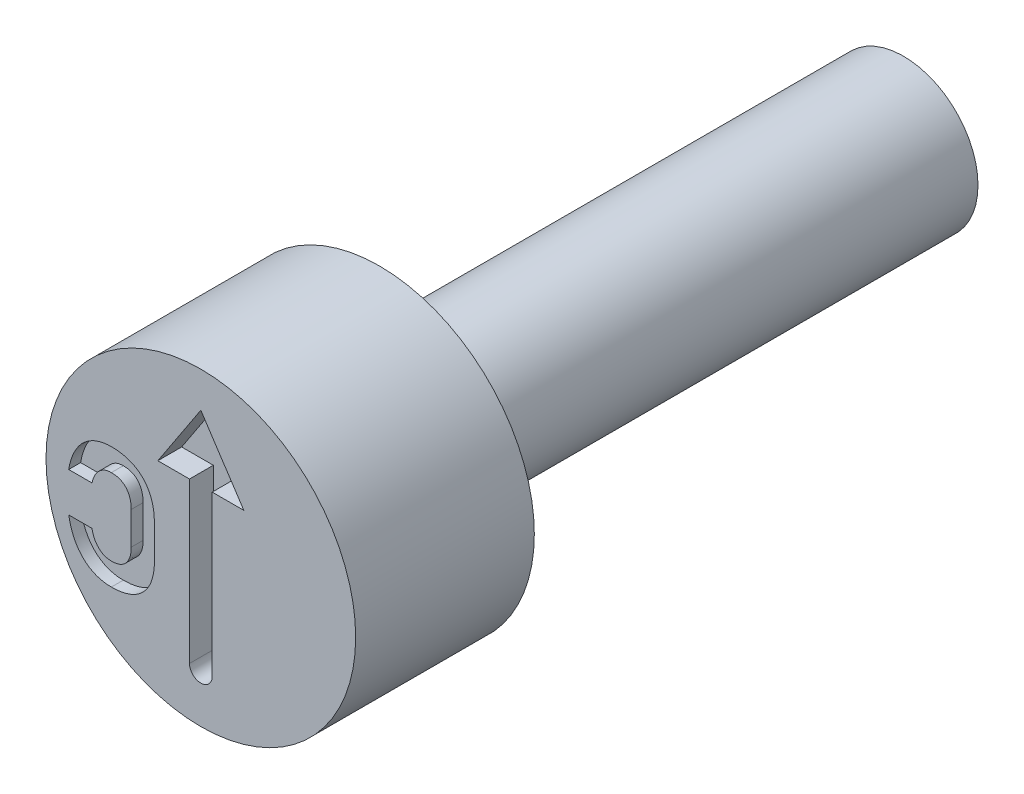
ISO-10303-21;
HEADER;
FILE_DESCRIPTION(('STEP AP214'),'2;1');
FILE_NAME('part.step','',(''),(''),'','','');
FILE_SCHEMA(('AUTOMOTIVE_DESIGN { 1 0 10303 214 1 1 1 1 }'));
ENDSEC;
DATA;
#1=APPLICATION_CONTEXT('core data for automotive mechanical design processes');
#2=APPLICATION_PROTOCOL_DEFINITION('international standard','automotive_design',2000,#1);
#3=PRODUCT_CONTEXT('',#1,'mechanical');
#4=PRODUCT('Part','Part','',(#3));
#5=PRODUCT_RELATED_PRODUCT_CATEGORY('part','',(#4));
#6=PRODUCT_DEFINITION_FORMATION('','',#4);
#7=PRODUCT_DEFINITION_CONTEXT('part definition',#1,'design');
#8=PRODUCT_DEFINITION('design','',#6,#7);
#9=PRODUCT_DEFINITION_SHAPE('','',#8);
#10=(LENGTH_UNIT() NAMED_UNIT(*) SI_UNIT(.MILLI.,.METRE.));
#11=(NAMED_UNIT(*) PLANE_ANGLE_UNIT() SI_UNIT($,.RADIAN.));
#12=(NAMED_UNIT(*) SI_UNIT($,.STERADIAN.) SOLID_ANGLE_UNIT());
#13=UNCERTAINTY_MEASURE_WITH_UNIT(LENGTH_MEASURE(1.E-05),#10,'distance_accuracy_value','');
#14=(GEOMETRIC_REPRESENTATION_CONTEXT(3) GLOBAL_UNCERTAINTY_ASSIGNED_CONTEXT((#13)) GLOBAL_UNIT_ASSIGNED_CONTEXT((#10,
#11,#12)) REPRESENTATION_CONTEXT('',''));
#15=CARTESIAN_POINT('',(0.,0.,0.));
#16=DIRECTION('',(0.,0.,1.));
#17=DIRECTION('',(1.,0.,0.));
#18=AXIS2_PLACEMENT_3D('',#15,#16,#17);
#19=CARTESIAN_POINT('',(0.,1.25,-3.));
#20=DIRECTION('',(0.,0.,1.));
#21=DIRECTION('',(1.,0.,0.));
#22=AXIS2_PLACEMENT_3D('',#19,#20,#21);
#23=PLANE('',#22);
#24=CARTESIAN_POINT('',(0.,0.,-3.));
#25=DIRECTION('',(0.,0.,1.));
#26=DIRECTION('',(1.,0.,0.));
#27=AXIS2_PLACEMENT_3D('',#24,#25,#26);
#28=CIRCLE('',#27,2.6);
#29=CARTESIAN_POINT('',(2.6,0.,-3.));
#30=VERTEX_POINT('',#29);
#31=EDGE_CURVE('E11',#30,#30,#28,.T.);
#32=ORIENTED_EDGE('',*,*,#31,.F.);
#33=EDGE_LOOP('',(#32));
#34=FACE_BOUND('',#33,.T.);
#35=CARTESIAN_POINT('',(0.,0.,-3.));
#36=DIRECTION('',(0.,0.,1.));
#37=DIRECTION('',(1.,0.,0.));
#38=AXIS2_PLACEMENT_3D('',#35,#36,#37);
#39=CIRCLE('',#38,1.25);
#40=CARTESIAN_POINT('',(1.25,0.,-3.));
#41=VERTEX_POINT('',#40);
#42=EDGE_CURVE('E262',#41,#41,#39,.T.);
#43=ORIENTED_EDGE('',*,*,#42,.T.);
#44=EDGE_LOOP('',(#43));
#45=FACE_BOUND('',#44,.T.);
#46=ADVANCED_FACE('F34',(#34,#45),#23,.F.);
#47=CARTESIAN_POINT('',(0.,0.,-0.403888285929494));
#48=DIRECTION('',(0.,0.,1.));
#49=DIRECTION('',(1.,0.,0.));
#50=AXIS2_PLACEMENT_3D('',#47,#48,#49);
#51=CYLINDRICAL_SURFACE('',#50,2.6);
#52=CARTESIAN_POINT('',(0.,0.,0.));
#53=DIRECTION('',(0.,0.,1.));
#54=DIRECTION('',(1.,0.,0.));
#55=AXIS2_PLACEMENT_3D('',#52,#53,#54);
#56=CIRCLE('',#55,2.6);
#57=CARTESIAN_POINT('',(2.6,0.,0.));
#58=VERTEX_POINT('',#57);
#59=EDGE_CURVE('E41',#58,#58,#56,.T.);
#60=ORIENTED_EDGE('',*,*,#59,.F.);
#61=EDGE_LOOP('',(#60));
#62=FACE_BOUND('',#61,.T.);
#63=ORIENTED_EDGE('',*,*,#31,.T.);
#64=EDGE_LOOP('',(#63));
#65=FACE_BOUND('',#64,.T.);
#66=ADVANCED_FACE('F247',(#62,#65),#51,.T.);
#67=CARTESIAN_POINT('',(0.,2.6,0.));
#68=DIRECTION('',(0.,0.,-1.));
#69=DIRECTION('',(-1.,0.,0.));
#70=AXIS2_PLACEMENT_3D('',#67,#68,#69);
#71=PLANE('',#70);
#72=CARTESIAN_POINT('',(-1.50238434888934,-1.32078663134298,0.));
#73=CARTESIAN_POINT('',(-1.48376416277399,-1.32058522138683,0.));
#74=CARTESIAN_POINT('',(-1.44702076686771,-1.32018777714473,0.));
#75=CARTESIAN_POINT('',(-1.39299257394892,-1.31605229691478,0.));
#76=CARTESIAN_POINT('',(-1.34086860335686,-1.30913923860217,0.));
#77=CARTESIAN_POINT('',(-1.2909331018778,-1.29939059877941,0.));
#78=CARTESIAN_POINT('',(-1.24304812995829,-1.28709241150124,0.));
#79=CARTESIAN_POINT('',(-1.19700867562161,-1.27255629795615,0.));
#80=CARTESIAN_POINT('',(-1.15325773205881,-1.25456123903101,0.));
#81=CARTESIAN_POINT('',(-1.11137066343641,-1.23415450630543,0.));
#82=CARTESIAN_POINT('',(-1.07193732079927,-1.21105723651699,0.));
#83=CARTESIAN_POINT('',(-1.03504126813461,-1.18507763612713,0.));
#84=CARTESIAN_POINT('',(-1.00031666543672,-1.15703082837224,0.));
#85=CARTESIAN_POINT('',(-0.968027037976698,-1.1263544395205,0.));
#86=CARTESIAN_POINT('',(-0.938205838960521,-1.09322771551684,0.));
#87=CARTESIAN_POINT('',(-0.910683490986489,-1.05761393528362,0.));
#88=CARTESIAN_POINT('',(-0.886025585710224,-1.01928589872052,0.));
#89=CARTESIAN_POINT('',(-0.863468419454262,-0.97876007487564,0.));
#90=CARTESIAN_POINT('',(-0.843399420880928,-0.935925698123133,0.));
#91=CARTESIAN_POINT('',(-0.826460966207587,-0.89057832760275,0.));
#92=CARTESIAN_POINT('',(-0.811775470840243,-0.843218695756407,0.));
#93=CARTESIAN_POINT('',(-0.799490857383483,-0.793854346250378,0.));
#94=CARTESIAN_POINT('',(-0.790085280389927,-0.742260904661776,0.));
#95=CARTESIAN_POINT('',(-0.783815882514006,-0.688477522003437,0.));
#96=CARTESIAN_POINT('',(-0.779469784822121,-0.632453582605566,0.));
#97=CARTESIAN_POINT('',(-0.779111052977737,-0.594350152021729,0.));
#98=CARTESIAN_POINT('',(-0.778928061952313,-0.574913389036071,0.));
#99=B_SPLINE_CURVE_WITH_KNOTS('',3,(#72,#73,#74,#75,#76,#77,#78,#79,#80,#81,#82,#83,#84,#85,#86,
#87,#88,#89,#90,#91,#92,#93,#94,#95,#96,#97,#98),.UNSPECIFIED.,.F.,.F.,(4,1,1,1,1,1,1,1,1,1,1,1,
1,1,1,1,1,1,1,1,1,1,1,1,4),(0.,0.0472598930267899,0.0932584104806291,0.137448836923,
0.180669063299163,0.222325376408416,0.262898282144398,0.303117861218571,0.342294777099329,
0.381096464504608,0.418984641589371,0.456742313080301,0.494310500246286,0.531916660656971,
0.569787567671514,0.608434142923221,0.647492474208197,0.687453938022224,0.728384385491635,
0.770272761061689,0.813266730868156,0.85743965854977,0.903297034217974,0.950671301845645,1.),.UNSPECIFIED.);
#100=CARTESIAN_POINT('',(-1.50238434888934,-1.32078663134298,0.));
#101=VERTEX_POINT('',#100);
#102=CARTESIAN_POINT('',(-0.778928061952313,-0.574913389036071,0.));
#103=VERTEX_POINT('',#102);
#104=EDGE_CURVE('E400',#101,#103,#99,.T.);
#105=ORIENTED_EDGE('',*,*,#104,.F.);
#106=CARTESIAN_POINT('',(-2.21891175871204,-0.629936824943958,0.));
#107=CARTESIAN_POINT('',(-2.21194612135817,-0.665278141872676,0.));
#108=CARTESIAN_POINT('',(-2.19840365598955,-0.733988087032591,0.));
#109=CARTESIAN_POINT('',(-2.16797139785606,-0.831835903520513,0.));
#110=CARTESIAN_POINT('',(-2.13046889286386,-0.921736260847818,0.));
#111=CARTESIAN_POINT('',(-2.08583881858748,-1.0035543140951,0.));
#112=CARTESIAN_POINT('',(-2.0338090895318,-1.07648101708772,0.));
#113=CARTESIAN_POINT('',(-1.97562461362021,-1.14078910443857,0.));
#114=CARTESIAN_POINT('',(-1.91079369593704,-1.19593589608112,0.));
#115=CARTESIAN_POINT('',(-1.8394496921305,-1.24136724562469,0.));
#116=CARTESIAN_POINT('',(-1.76241487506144,-1.27708329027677,0.));
#117=CARTESIAN_POINT('',(-1.68011083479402,-1.30216581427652,0.));
#118=CARTESIAN_POINT('',(-1.59296170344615,-1.31839293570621,0.));
#119=CARTESIAN_POINT('',(-1.53302745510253,-1.31997682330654,0.));
#120=CARTESIAN_POINT('',(-1.50238434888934,-1.32078663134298,0.));
#121=B_SPLINE_CURVE_WITH_KNOTS('',3,(#106,#107,#108,#109,#110,#111,#112,#113,#114,#115,#116,
#117,#118,#119,#120),.UNSPECIFIED.,.F.,.F.,(4,1,1,1,1,1,1,1,1,1,1,1,4),(0.,0.098823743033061,
0.192131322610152,0.28071953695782,0.365844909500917,0.447392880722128,0.52606487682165,
0.603327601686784,0.680299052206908,0.757555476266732,0.835645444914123,0.915969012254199,1.),.UNSPECIFIED.);
#122=CARTESIAN_POINT('',(-2.21891175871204,-0.629936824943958,0.));
#123=VERTEX_POINT('',#122);
#124=EDGE_CURVE('E48',#123,#101,#121,.T.);
#125=ORIENTED_EDGE('',*,*,#124,.F.);
#126=DIRECTION('',(-1.,0.,0.));
#127=VECTOR('',#126,1.);
#128=CARTESIAN_POINT('',(-1.82844915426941,-0.629936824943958,0.));
#129=LINE('',#128,#127);
#130=CARTESIAN_POINT('',(-1.82844915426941,-0.629936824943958,0.));
#131=VERTEX_POINT('',#130);
#132=EDGE_CURVE('E185',#131,#123,#129,.T.);
#133=ORIENTED_EDGE('',*,*,#132,.F.);
#134=CARTESIAN_POINT('',(-1.50238434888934,-0.943774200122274,0.));
#135=CARTESIAN_POINT('',(-1.51585596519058,-0.943243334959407,0.));
#136=CARTESIAN_POINT('',(-1.54227902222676,-0.942202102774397,0.));
#137=CARTESIAN_POINT('',(-1.58088042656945,-0.935827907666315,0.));
#138=CARTESIAN_POINT('',(-1.61722488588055,-0.92408059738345,0.));
#139=CARTESIAN_POINT('',(-1.6515576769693,-0.908252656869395,0.));
#140=CARTESIAN_POINT('',(-1.6836271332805,-0.887803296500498,0.));
#141=CARTESIAN_POINT('',(-1.71251904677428,-0.862536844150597,0.));
#142=CARTESIAN_POINT('',(-1.73943017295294,-0.833776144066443,0.));
#143=CARTESIAN_POINT('',(-1.76338193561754,-0.800584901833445,0.));
#144=CARTESIAN_POINT('',(-1.78461424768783,-0.763442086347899,0.));
#145=CARTESIAN_POINT('',(-1.8023703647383,-0.72233341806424,0.));
#146=CARTESIAN_POINT('',(-1.81778326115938,-0.677716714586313,0.));
#147=CARTESIAN_POINT('',(-1.82482104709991,-0.646189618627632,0.));
#148=CARTESIAN_POINT('',(-1.82844915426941,-0.629936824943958,0.));
#149=B_SPLINE_CURVE_WITH_KNOTS('',3,(#134,#135,#136,#137,#138,#139,#140,#141,#142,#143,#144,
#145,#146,#147,#148),.UNSPECIFIED.,.F.,.F.,(4,1,1,1,1,1,1,1,1,1,1,1,4),(0.,0.0817564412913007,
0.160356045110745,0.236478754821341,0.312819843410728,0.389192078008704,0.466352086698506,
0.545094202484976,0.627698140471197,0.714093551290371,0.80415108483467,0.89903630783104,1.),.UNSPECIFIED.);
#150=CARTESIAN_POINT('',(-1.50238434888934,-0.943774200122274,0.));
#151=VERTEX_POINT('',#150);
#152=EDGE_CURVE('E188',#151,#131,#149,.T.);
#153=ORIENTED_EDGE('',*,*,#152,.F.);
#154=CARTESIAN_POINT('',(-1.16939066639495,-0.574913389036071,0.));
#155=CARTESIAN_POINT('',(-1.16983000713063,-0.593686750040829,0.));
#156=CARTESIAN_POINT('',(-1.17068047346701,-0.630027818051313,0.));
#157=CARTESIAN_POINT('',(-1.1780484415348,-0.682382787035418,0.));
#158=CARTESIAN_POINT('',(-1.19023829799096,-0.730541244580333,0.));
#159=CARTESIAN_POINT('',(-1.20715034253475,-0.774421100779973,0.));
#160=CARTESIAN_POINT('',(-1.22936552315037,-0.813396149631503,0.));
#161=CARTESIAN_POINT('',(-1.255747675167,-0.847781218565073,0.));
#162=CARTESIAN_POINT('',(-1.28644922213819,-0.877493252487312,0.));
#163=CARTESIAN_POINT('',(-1.32194671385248,-0.901667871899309,0.));
#164=CARTESIAN_POINT('',(-1.36154593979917,-0.920577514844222,0.));
#165=CARTESIAN_POINT('',(-1.40509536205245,-0.933869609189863,0.));
#166=CARTESIAN_POINT('',(-1.45247894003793,-0.942213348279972,0.));
#167=CARTESIAN_POINT('',(-1.48536542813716,-0.94324191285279,0.));
#168=CARTESIAN_POINT('',(-1.50238434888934,-0.943774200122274,0.));
#169=B_SPLINE_CURVE_WITH_KNOTS('',3,(#154,#155,#156,#157,#158,#159,#160,#161,#162,#163,#164,
#165,#166,#167,#168),.UNSPECIFIED.,.F.,.F.,(4,1,1,1,1,1,1,1,1,1,1,1,4),(0.,0.0997433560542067,
0.193081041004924,0.280299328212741,0.363302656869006,0.442209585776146,0.517891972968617,
0.592965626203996,0.66827505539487,0.745143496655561,0.825309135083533,0.909596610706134,1.),.UNSPECIFIED.);
#170=CARTESIAN_POINT('',(-1.16939066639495,-0.574913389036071,0.));
#171=VERTEX_POINT('',#170);
#172=EDGE_CURVE('E348',#171,#151,#169,.T.);
#173=ORIENTED_EDGE('',*,*,#172,.F.);
#174=DIRECTION('',(0.,-1.,0.));
#175=VECTOR('',#174,1.);
#176=CARTESIAN_POINT('',(-1.16939066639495,-0.0263093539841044,0.));
#177=LINE('',#176,#175);
#178=CARTESIAN_POINT('',(-1.16939066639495,-0.0263093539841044,0.));
#179=VERTEX_POINT('',#178);
#180=EDGE_CURVE('E356',#179,#171,#177,.T.);
#181=ORIENTED_EDGE('',*,*,#180,.F.);
#182=CARTESIAN_POINT('',(-1.50238434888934,0.343774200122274,0.));
#183=CARTESIAN_POINT('',(-1.48537812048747,0.343178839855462,0.));
#184=CARTESIAN_POINT('',(-1.45253886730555,0.342029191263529,0.));
#185=CARTESIAN_POINT('',(-1.4049653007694,0.334539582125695,0.));
#186=CARTESIAN_POINT('',(-1.36163104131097,0.320430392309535,0.));
#187=CARTESIAN_POINT('',(-1.32193086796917,0.301713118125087,0.));
#188=CARTESIAN_POINT('',(-1.28646622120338,0.277470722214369,0.));
#189=CARTESIAN_POINT('',(-1.25561723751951,0.247751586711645,0.));
#190=CARTESIAN_POINT('',(-1.22936834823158,0.212959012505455,0.));
#191=CARTESIAN_POINT('',(-1.20724991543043,0.173691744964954,0.));
#192=CARTESIAN_POINT('',(-1.19014750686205,0.129616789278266,0.));
#193=CARTESIAN_POINT('',(-1.1781140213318,0.0812779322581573,0.));
#194=CARTESIAN_POINT('',(-1.17066741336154,0.0288086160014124,0.));
#195=CARTESIAN_POINT('',(-1.16982555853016,-0.00753478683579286,0.));
#196=CARTESIAN_POINT('',(-1.16939066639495,-0.0263093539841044,0.));
#197=B_SPLINE_CURVE_WITH_KNOTS('',3,(#182,#183,#184,#185,#186,#187,#188,#189,#190,#191,#192,
#193,#194,#195,#196),.UNSPECIFIED.,.F.,.F.,(4,1,1,1,1,1,1,1,1,1,1,1,4),(0.,0.0902231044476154,
0.174222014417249,0.25444494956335,0.331160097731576,0.406319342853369,0.481243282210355,
0.557346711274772,0.636723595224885,0.719561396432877,0.807304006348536,0.900455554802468,1.),.UNSPECIFIED.);
#198=CARTESIAN_POINT('',(-1.50238434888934,0.343774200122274,0.));
#199=VERTEX_POINT('',#198);
#200=EDGE_CURVE('E362',#199,#179,#197,.T.);
#201=ORIENTED_EDGE('',*,*,#200,.F.);
#202=CARTESIAN_POINT('',(-1.82844915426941,0.0303444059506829,0.));
#203=CARTESIAN_POINT('',(-1.82451062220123,0.0463203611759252,0.));
#204=CARTESIAN_POINT('',(-1.81684659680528,0.077408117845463,0.));
#205=CARTESIAN_POINT('',(-1.80106692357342,0.121633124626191,0.));
#206=CARTESIAN_POINT('',(-1.78312385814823,0.162597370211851,0.));
#207=CARTESIAN_POINT('',(-1.76117953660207,0.199324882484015,0.));
#208=CARTESIAN_POINT('',(-1.73729068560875,0.232702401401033,0.));
#209=CARTESIAN_POINT('',(-1.71034958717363,0.261619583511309,0.));
#210=CARTESIAN_POINT('',(-1.68094591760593,0.286556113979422,0.));
#211=CARTESIAN_POINT('',(-1.64930672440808,0.307180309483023,0.));
#212=CARTESIAN_POINT('',(-1.61551816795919,0.323988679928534,0.));
#213=CARTESIAN_POINT('',(-1.5794264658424,0.335112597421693,0.));
#214=CARTESIAN_POINT('',(-1.54152986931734,0.342376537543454,0.));
#215=CARTESIAN_POINT('',(-1.51559726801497,0.343302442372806,0.));
#216=CARTESIAN_POINT('',(-1.50238434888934,0.343774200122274,0.));
#217=B_SPLINE_CURVE_WITH_KNOTS('',3,(#202,#203,#204,#205,#206,#207,#208,#209,#210,#211,#212,
#213,#214,#215,#216),.UNSPECIFIED.,.F.,.F.,(4,1,1,1,1,1,1,1,1,1,1,1,4),(0.,0.100258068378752,
0.195093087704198,0.285925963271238,0.37244127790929,0.455447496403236,0.535743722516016,
0.612742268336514,0.689936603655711,0.765509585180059,0.842003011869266,0.919498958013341,1.),.UNSPECIFIED.);
#218=CARTESIAN_POINT('',(-1.82844915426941,0.0303444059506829,0.));
#219=VERTEX_POINT('',#218);
#220=EDGE_CURVE('E367',#219,#199,#217,.T.);
#221=ORIENTED_EDGE('',*,*,#220,.F.);
#222=DIRECTION('',(1.,0.,0.));
#223=VECTOR('',#222,1.);
#224=CARTESIAN_POINT('',(-2.21891175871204,0.0303444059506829,0.));
#225=LINE('',#224,#223);
#226=CARTESIAN_POINT('',(-2.21891175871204,0.0303444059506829,0.));
#227=VERTEX_POINT('',#226);
#228=EDGE_CURVE('E375',#227,#219,#225,.T.);
#229=ORIENTED_EDGE('',*,*,#228,.F.);
#230=CARTESIAN_POINT('',(-1.50238434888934,0.720786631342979,0.));
#231=CARTESIAN_POINT('',(-1.53302591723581,0.719966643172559,0.));
#232=CARTESIAN_POINT('',(-1.59309102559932,0.71835926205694,0.));
#233=CARTESIAN_POINT('',(-1.68039098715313,0.702220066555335,0.));
#234=CARTESIAN_POINT('',(-1.76283067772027,0.67709328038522,0.));
#235=CARTESIAN_POINT('',(-1.8399282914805,0.641264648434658,0.));
#236=CARTESIAN_POINT('',(-1.91144246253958,0.596059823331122,0.));
#237=CARTESIAN_POINT('',(-1.9765359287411,0.541059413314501,0.));
#238=CARTESIAN_POINT('',(-2.03518679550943,0.47698368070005,0.));
#239=CARTESIAN_POINT('',(-2.08688879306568,0.403570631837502,0.));
#240=CARTESIAN_POINT('',(-2.13178919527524,0.321844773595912,0.));
#241=CARTESIAN_POINT('',(-2.16875291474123,0.231796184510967,0.));
#242=CARTESIAN_POINT('',(-2.19875648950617,0.134096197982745,0.));
#243=CARTESIAN_POINT('',(-2.21207324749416,0.0655465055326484,0.));
#244=CARTESIAN_POINT('',(-2.21891175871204,0.0303444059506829,0.));
#245=B_SPLINE_CURVE_WITH_KNOTS('',3,(#230,#231,#232,#233,#234,#235,#236,#237,#238,#239,#240,
#241,#242,#243,#244),.UNSPECIFIED.,.F.,.F.,(4,1,1,1,1,1,1,1,1,1,1,1,4),(0.,0.0840057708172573,
0.164672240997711,0.242738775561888,0.319972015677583,0.397234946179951,0.474233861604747,
0.553133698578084,0.634960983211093,0.720060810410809,0.808478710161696,0.901648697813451,1.),.UNSPECIFIED.);
#246=CARTESIAN_POINT('',(-1.50238434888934,0.720786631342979,0.));
#247=VERTEX_POINT('',#246);
#248=EDGE_CURVE('E381',#247,#227,#245,.T.);
#249=ORIENTED_EDGE('',*,*,#248,.F.);
#250=CARTESIAN_POINT('',(-0.778928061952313,-0.0263093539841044,0.));
#251=CARTESIAN_POINT('',(-0.77911105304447,-0.00687259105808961,0.));
#252=CARTESIAN_POINT('',(-0.779469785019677,0.0312308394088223,0.));
#253=CARTESIAN_POINT('',(-0.783815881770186,0.0872547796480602,0.));
#254=CARTESIAN_POINT('',(-0.790085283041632,0.141038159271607,0.));
#255=CARTESIAN_POINT('',(-0.799490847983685,0.192631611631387,0.));
#256=CARTESIAN_POINT('',(-0.811775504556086,0.241995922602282,0.));
#257=CARTESIAN_POINT('',(-0.826460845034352,0.289355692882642,0.));
#258=CARTESIAN_POINT('',(-0.843399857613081,0.334702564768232,0.));
#259=CARTESIAN_POINT('',(-0.863466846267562,0.377538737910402,0.));
#260=CARTESIAN_POINT('',(-0.88603128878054,0.418058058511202,0.));
#261=CARTESIAN_POINT('',(-0.910662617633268,0.456409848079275,0.));
#262=CARTESIAN_POINT('',(-0.938343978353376,0.492017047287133,0.));
#263=CARTESIAN_POINT('',(-0.967881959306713,0.525533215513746,0.));
#264=CARTESIAN_POINT('',(-1.0003348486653,0.556200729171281,0.));
#265=CARTESIAN_POINT('',(-1.03504032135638,0.584258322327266,0.));
#266=CARTESIAN_POINT('',(-1.07192265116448,0.610274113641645,0.));
#267=CARTESIAN_POINT('',(-1.11148440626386,0.633241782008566,0.));
#268=CARTESIAN_POINT('',(-1.15313023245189,0.654287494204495,0.));
#269=CARTESIAN_POINT('',(-1.19710785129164,0.671997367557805,0.));
#270=CARTESIAN_POINT('',(-1.24295785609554,0.687228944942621,0.));
#271=CARTESIAN_POINT('',(-1.29094704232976,0.699349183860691,0.));
#272=CARTESIAN_POINT('',(-1.34086472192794,0.709150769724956,0.));
#273=CARTESIAN_POINT('',(-1.39299366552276,0.716049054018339,0.));
#274=CARTESIAN_POINT('',(-1.44702048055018,0.720188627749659,0.));
#275=CARTESIAN_POINT('',(-1.48376406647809,0.720585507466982,0.));
#276=CARTESIAN_POINT('',(-1.50238434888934,0.720786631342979,0.));
#277=B_SPLINE_CURVE_WITH_KNOTS('',3,(#250,#251,#252,#253,#254,#255,#256,#257,#258,#259,#260,
#261,#262,#263,#264,#265,#266,#267,#268,#269,#270,#271,#272,#273,#274,#275,#276),.UNSPECIFIED.,
.F.,.F.,(4,1,1,1,1,1,1,1,1,1,1,1,1,1,1,1,1,1,1,1,1,1,1,1,4),(0.,0.0493032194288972,
0.0966530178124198,0.142486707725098,0.186636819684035,0.229608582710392,0.271475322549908,
0.31238462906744,0.352325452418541,0.391363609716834,0.429990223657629,0.467841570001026,
0.505685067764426,0.543233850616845,0.580972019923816,0.618840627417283,0.657622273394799,
0.696931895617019,0.737130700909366,0.777789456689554,0.819424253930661,0.862622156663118,
0.906789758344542,0.952764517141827,1.),.UNSPECIFIED.);
#278=CARTESIAN_POINT('',(-0.778928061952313,-0.0263093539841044,0.));
#279=VERTEX_POINT('',#278);
#280=EDGE_CURVE('E386',#279,#247,#277,.T.);
#281=ORIENTED_EDGE('',*,*,#280,.F.);
#282=DIRECTION('',(0.,1.,0.));
#283=VECTOR('',#282,1.);
#284=CARTESIAN_POINT('',(-0.778928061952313,-0.574913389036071,0.));
#285=LINE('',#284,#283);
#286=EDGE_CURVE('E394',#103,#279,#285,.T.);
#287=ORIENTED_EDGE('',*,*,#286,.F.);
#288=EDGE_LOOP('',(#105,#125,#133,#153,#173,#181,#201,#221,#229,#249,#281,#287));
#289=FACE_BOUND('',#288,.T.);
#290=DIRECTION('',(0.,1.,0.));
#291=VECTOR('',#290,1.);
#292=CARTESIAN_POINT('',(0.190473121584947,0.906351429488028,0.));
#293=LINE('',#292,#291);
#294=CARTESIAN_POINT('',(0.190473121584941,-1.77616183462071,0.));
#295=VERTEX_POINT('',#294);
#296=CARTESIAN_POINT('',(0.190473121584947,0.906351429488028,0.));
#297=VERTEX_POINT('',#296);
#298=EDGE_CURVE('E300',#295,#297,#293,.T.);
#299=ORIENTED_EDGE('',*,*,#298,.F.);
#300=CARTESIAN_POINT('',(1.6342449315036E-13,-1.77616183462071,0.));
#301=DIRECTION('',(0.,0.,1.));
#302=DIRECTION('',(1.,0.,0.));
#303=AXIS2_PLACEMENT_3D('',#300,#301,#302);
#304=CIRCLE('',#303,0.190473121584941);
#305=CARTESIAN_POINT('',(-0.190473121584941,-1.77616183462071,0.));
#306=VERTEX_POINT('',#305);
#307=EDGE_CURVE('E56',#306,#295,#304,.T.);
#308=ORIENTED_EDGE('',*,*,#307,.F.);
#309=DIRECTION('',(0.,-1.,0.));
#310=VECTOR('',#309,1.);
#311=CARTESIAN_POINT('',(-0.190473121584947,0.906351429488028,0.));
#312=LINE('',#311,#310);
#313=CARTESIAN_POINT('',(-0.190473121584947,0.906351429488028,0.));
#314=VERTEX_POINT('',#313);
#315=EDGE_CURVE('E284',#314,#306,#312,.T.);
#316=ORIENTED_EDGE('',*,*,#315,.F.);
#317=DIRECTION('',(1.,0.,0.));
#318=VECTOR('',#317,1.);
#319=CARTESIAN_POINT('',(-0.721917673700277,0.906351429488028,0.));
#320=LINE('',#319,#318);
#321=CARTESIAN_POINT('',(-0.721917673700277,0.906351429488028,0.));
#322=VERTEX_POINT('',#321);
#323=EDGE_CURVE('E288',#322,#314,#320,.T.);
#324=ORIENTED_EDGE('',*,*,#323,.F.);
#325=DIRECTION('',(-0.550159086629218,-0.835059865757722,0.));
#326=VECTOR('',#325,1.);
#327=CARTESIAN_POINT('',(0.,2.00211534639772,0.));
#328=LINE('',#327,#326);
#329=CARTESIAN_POINT('',(0.,2.00211534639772,0.));
#330=VERTEX_POINT('',#329);
#331=EDGE_CURVE('E291',#330,#322,#328,.T.);
#332=ORIENTED_EDGE('',*,*,#331,.F.);
#333=DIRECTION('',(-0.550159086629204,0.835059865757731,0.));
#334=VECTOR('',#333,1.);
#335=CARTESIAN_POINT('',(0.,2.00211534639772,0.));
#336=LINE('',#335,#334);
#337=CARTESIAN_POINT('',(0.721917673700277,0.906351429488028,0.));
#338=VERTEX_POINT('',#337);
#339=EDGE_CURVE('E294',#338,#330,#336,.T.);
#340=ORIENTED_EDGE('',*,*,#339,.F.);
#341=DIRECTION('',(1.,0.,0.));
#342=VECTOR('',#341,1.);
#343=CARTESIAN_POINT('',(0.721917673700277,0.906351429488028,0.));
#344=LINE('',#343,#342);
#345=EDGE_CURVE('E297',#297,#338,#344,.T.);
#346=ORIENTED_EDGE('',*,*,#345,.F.);
#347=EDGE_LOOP('',(#299,#308,#316,#324,#332,#340,#346));
#348=FACE_BOUND('',#347,.T.);
#349=ORIENTED_EDGE('',*,*,#59,.T.);
#350=EDGE_LOOP('',(#349));
#351=FACE_BOUND('',#350,.T.);
#352=ADVANCED_FACE('F244',(#289,#348,#351),#71,.F.);
#353=CARTESIAN_POINT('',(0.,0.,-11.8));
#354=DIRECTION('',(0.,0.,1.));
#355=DIRECTION('',(1.,0.,0.));
#356=AXIS2_PLACEMENT_3D('',#353,#354,#355);
#357=PLANE('',#356);
#358=CARTESIAN_POINT('',(0.,0.,-11.8));
#359=DIRECTION('',(0.,0.,1.));
#360=DIRECTION('',(1.,0.,0.));
#361=AXIS2_PLACEMENT_3D('',#358,#359,#360);
#362=CIRCLE('',#361,1.25);
#363=CARTESIAN_POINT('',(1.25,0.,-11.8));
#364=VERTEX_POINT('',#363);
#365=EDGE_CURVE('E263',#364,#364,#362,.T.);
#366=ORIENTED_EDGE('',*,*,#365,.F.);
#367=EDGE_LOOP('',(#366));
#368=FACE_BOUND('',#367,.T.);
#369=ADVANCED_FACE('F240',(#368),#357,.F.);
#370=CARTESIAN_POINT('',(0.,0.,-0.403888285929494));
#371=DIRECTION('',(0.,0.,1.));
#372=DIRECTION('',(1.,0.,0.));
#373=AXIS2_PLACEMENT_3D('',#370,#371,#372);
#374=CYLINDRICAL_SURFACE('',#373,1.25);
#375=ORIENTED_EDGE('',*,*,#42,.F.);
#376=EDGE_LOOP('',(#375));
#377=FACE_BOUND('',#376,.T.);
#378=ORIENTED_EDGE('',*,*,#365,.T.);
#379=EDGE_LOOP('',(#378));
#380=FACE_BOUND('',#379,.T.);
#381=ADVANCED_FACE('F237',(#377,#380),#374,.T.);
#382=CARTESIAN_POINT('',(1.6342449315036E-13,-1.77616183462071,-0.4));
#383=DIRECTION('',(0.,0.,1.));
#384=DIRECTION('',(1.,0.,0.));
#385=AXIS2_PLACEMENT_3D('',#382,#383,#384);
#386=CYLINDRICAL_SURFACE('',#385,0.190473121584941);
#387=ORIENTED_EDGE('',*,*,#307,.T.);
#388=DIRECTION('',(0.,0.,1.));
#389=VECTOR('',#388,1.);
#390=CARTESIAN_POINT('',(0.190473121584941,-1.77616183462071,-0.4));
#391=LINE('',#390,#389);
#392=CARTESIAN_POINT('',(0.190473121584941,-1.77616183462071,-0.4));
#393=VERTEX_POINT('',#392);
#394=EDGE_CURVE('E271',#393,#295,#391,.T.);
#395=ORIENTED_EDGE('',*,*,#394,.F.);
#396=CARTESIAN_POINT('',(1.6342449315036E-13,-1.77616183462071,-0.4));
#397=DIRECTION('',(0.,0.,1.));
#398=DIRECTION('',(1.,0.,0.));
#399=AXIS2_PLACEMENT_3D('',#396,#397,#398);
#400=CIRCLE('',#399,0.190473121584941);
#401=CARTESIAN_POINT('',(-0.190473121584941,-1.77616183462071,-0.4));
#402=VERTEX_POINT('',#401);
#403=EDGE_CURVE('E287',#402,#393,#400,.T.);
#404=ORIENTED_EDGE('',*,*,#403,.F.);
#405=DIRECTION('',(0.,0.,1.));
#406=VECTOR('',#405,1.);
#407=CARTESIAN_POINT('',(-0.190473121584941,-1.77616183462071,-0.4));
#408=LINE('',#407,#406);
#409=EDGE_CURVE('E264',#402,#306,#408,.T.);
#410=ORIENTED_EDGE('',*,*,#409,.T.);
#411=EDGE_LOOP('',(#387,#395,#404,#410));
#412=FACE_BOUND('',#411,.T.);
#413=ADVANCED_FACE('F215',(#412),#386,.F.);
#414=CARTESIAN_POINT('',(-0.190473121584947,0.906351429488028,-0.4));
#415=DIRECTION('',(-1.,0.,0.));
#416=DIRECTION('',(0.,-1.,0.));
#417=AXIS2_PLACEMENT_3D('',#414,#415,#416);
#418=PLANE('',#417);
#419=ORIENTED_EDGE('',*,*,#315,.T.);
#420=ORIENTED_EDGE('',*,*,#409,.F.);
#421=DIRECTION('',(0.,-1.,0.));
#422=VECTOR('',#421,1.);
#423=CARTESIAN_POINT('',(-0.190473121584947,0.906351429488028,-0.4));
#424=LINE('',#423,#422);
#425=CARTESIAN_POINT('',(-0.190473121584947,0.906351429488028,-0.4));
#426=VERTEX_POINT('',#425);
#427=EDGE_CURVE('E275',#426,#402,#424,.T.);
#428=ORIENTED_EDGE('',*,*,#427,.F.);
#429=DIRECTION('',(0.,0.,1.));
#430=VECTOR('',#429,1.);
#431=CARTESIAN_POINT('',(-0.190473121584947,0.906351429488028,-0.4));
#432=LINE('',#431,#430);
#433=EDGE_CURVE('E268',#426,#314,#432,.T.);
#434=ORIENTED_EDGE('',*,*,#433,.T.);
#435=EDGE_LOOP('',(#419,#420,#428,#434));
#436=FACE_BOUND('',#435,.T.);
#437=ADVANCED_FACE('F211',(#436),#418,.F.);
#438=CARTESIAN_POINT('',(-0.721917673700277,0.906351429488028,-0.4));
#439=DIRECTION('',(0.,-1.,0.));
#440=DIRECTION('',(0.,0.,-1.));
#441=AXIS2_PLACEMENT_3D('',#438,#439,#440);
#442=PLANE('',#441);
#443=ORIENTED_EDGE('',*,*,#323,.T.);
#444=ORIENTED_EDGE('',*,*,#433,.F.);
#445=DIRECTION('',(1.,0.,0.));
#446=VECTOR('',#445,1.);
#447=CARTESIAN_POINT('',(-0.721917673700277,0.906351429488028,-0.4));
#448=LINE('',#447,#446);
#449=CARTESIAN_POINT('',(-0.721917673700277,0.906351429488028,-0.4));
#450=VERTEX_POINT('',#449);
#451=EDGE_CURVE('E307',#450,#426,#448,.T.);
#452=ORIENTED_EDGE('',*,*,#451,.F.);
#453=DIRECTION('',(0.,0.,1.));
#454=VECTOR('',#453,1.);
#455=CARTESIAN_POINT('',(-0.721917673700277,0.906351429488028,-0.4));
#456=LINE('',#455,#454);
#457=EDGE_CURVE('E281',#450,#322,#456,.T.);
#458=ORIENTED_EDGE('',*,*,#457,.T.);
#459=EDGE_LOOP('',(#443,#444,#452,#458));
#460=FACE_BOUND('',#459,.T.);
#461=ADVANCED_FACE('F214',(#460),#442,.F.);
#462=CARTESIAN_POINT('',(0.,2.00211534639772,-0.4));
#463=DIRECTION('',(-0.835059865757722,0.550159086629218,0.));
#464=DIRECTION('',(-0.550159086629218,-0.835059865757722,0.));
#465=AXIS2_PLACEMENT_3D('',#462,#463,#464);
#466=PLANE('',#465);
#467=ORIENTED_EDGE('',*,*,#331,.T.);
#468=ORIENTED_EDGE('',*,*,#457,.F.);
#469=DIRECTION('',(-0.550159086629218,-0.835059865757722,0.));
#470=VECTOR('',#469,1.);
#471=CARTESIAN_POINT('',(0.,2.00211534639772,-0.4));
#472=LINE('',#471,#470);
#473=CARTESIAN_POINT('',(0.,2.00211534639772,-0.4));
#474=VERTEX_POINT('',#473);
#475=EDGE_CURVE('E310',#474,#450,#472,.T.);
#476=ORIENTED_EDGE('',*,*,#475,.F.);
#477=DIRECTION('',(0.,0.,1.));
#478=VECTOR('',#477,1.);
#479=CARTESIAN_POINT('',(0.,2.00211534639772,-0.4));
#480=LINE('',#479,#478);
#481=EDGE_CURVE('E279',#474,#330,#480,.T.);
#482=ORIENTED_EDGE('',*,*,#481,.T.);
#483=EDGE_LOOP('',(#467,#468,#476,#482));
#484=FACE_BOUND('',#483,.T.);
#485=ADVANCED_FACE('F219',(#484),#466,.F.);
#486=CARTESIAN_POINT('',(0.,2.00211534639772,-0.4));
#487=DIRECTION('',(0.835059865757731,0.550159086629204,0.));
#488=DIRECTION('',(-0.550159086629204,0.835059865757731,0.));
#489=AXIS2_PLACEMENT_3D('',#486,#487,#488);
#490=PLANE('',#489);
#491=ORIENTED_EDGE('',*,*,#339,.T.);
#492=ORIENTED_EDGE('',*,*,#481,.F.);
#493=DIRECTION('',(-0.550159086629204,0.835059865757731,0.));
#494=VECTOR('',#493,1.);
#495=CARTESIAN_POINT('',(0.,2.00211534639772,-0.4));
#496=LINE('',#495,#494);
#497=CARTESIAN_POINT('',(0.721917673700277,0.906351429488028,-0.4));
#498=VERTEX_POINT('',#497);
#499=EDGE_CURVE('E313',#498,#474,#496,.T.);
#500=ORIENTED_EDGE('',*,*,#499,.F.);
#501=DIRECTION('',(0.,0.,1.));
#502=VECTOR('',#501,1.);
#503=CARTESIAN_POINT('',(0.721917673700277,0.906351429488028,-0.4));
#504=LINE('',#503,#502);
#505=EDGE_CURVE('E277',#498,#338,#504,.T.);
#506=ORIENTED_EDGE('',*,*,#505,.T.);
#507=EDGE_LOOP('',(#491,#492,#500,#506));
#508=FACE_BOUND('',#507,.T.);
#509=ADVANCED_FACE('F223',(#508),#490,.F.);
#510=CARTESIAN_POINT('',(0.721917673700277,0.906351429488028,-0.4));
#511=DIRECTION('',(0.,-1.,0.));
#512=DIRECTION('',(0.,0.,-1.));
#513=AXIS2_PLACEMENT_3D('',#510,#511,#512);
#514=PLANE('',#513);
#515=ORIENTED_EDGE('',*,*,#345,.T.);
#516=ORIENTED_EDGE('',*,*,#505,.F.);
#517=DIRECTION('',(1.,0.,0.));
#518=VECTOR('',#517,1.);
#519=CARTESIAN_POINT('',(0.721917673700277,0.906351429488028,-0.4));
#520=LINE('',#519,#518);
#521=CARTESIAN_POINT('',(0.190473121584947,0.906351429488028,-0.4));
#522=VERTEX_POINT('',#521);
#523=EDGE_CURVE('E316',#522,#498,#520,.T.);
#524=ORIENTED_EDGE('',*,*,#523,.F.);
#525=DIRECTION('',(0.,0.,1.));
#526=VECTOR('',#525,1.);
#527=CARTESIAN_POINT('',(0.190473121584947,0.906351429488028,-0.4));
#528=LINE('',#527,#526);
#529=EDGE_CURVE('E274',#522,#297,#528,.T.);
#530=ORIENTED_EDGE('',*,*,#529,.T.);
#531=EDGE_LOOP('',(#515,#516,#524,#530));
#532=FACE_BOUND('',#531,.T.);
#533=ADVANCED_FACE('F227',(#532),#514,.F.);
#534=CARTESIAN_POINT('',(0.190473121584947,0.906351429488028,-0.4));
#535=DIRECTION('',(1.,0.,0.));
#536=DIRECTION('',(0.,1.,0.));
#537=AXIS2_PLACEMENT_3D('',#534,#535,#536);
#538=PLANE('',#537);
#539=ORIENTED_EDGE('',*,*,#298,.T.);
#540=ORIENTED_EDGE('',*,*,#529,.F.);
#541=DIRECTION('',(0.,1.,0.));
#542=VECTOR('',#541,1.);
#543=CARTESIAN_POINT('',(0.190473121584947,0.906351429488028,-0.4));
#544=LINE('',#543,#542);
#545=EDGE_CURVE('E319',#393,#522,#544,.T.);
#546=ORIENTED_EDGE('',*,*,#545,.F.);
#547=ORIENTED_EDGE('',*,*,#394,.T.);
#548=EDGE_LOOP('',(#539,#540,#546,#547));
#549=FACE_BOUND('',#548,.T.);
#550=ADVANCED_FACE('F209',(#549),#538,.F.);
#551=CARTESIAN_POINT('',(1.6342449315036E-13,-1.77616183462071,-0.4));
#552=DIRECTION('',(0.,0.,1.));
#553=DIRECTION('',(1.,0.,0.));
#554=AXIS2_PLACEMENT_3D('',#551,#552,#553);
#555=PLANE('',#554);
#556=ORIENTED_EDGE('',*,*,#403,.T.);
#557=ORIENTED_EDGE('',*,*,#545,.T.);
#558=ORIENTED_EDGE('',*,*,#523,.T.);
#559=ORIENTED_EDGE('',*,*,#499,.T.);
#560=ORIENTED_EDGE('',*,*,#475,.T.);
#561=ORIENTED_EDGE('',*,*,#451,.T.);
#562=ORIENTED_EDGE('',*,*,#427,.T.);
#563=EDGE_LOOP('',(#556,#557,#558,#559,#560,#561,#562));
#564=FACE_BOUND('',#563,.T.);
#565=ADVANCED_FACE('F205',(#564),#555,.T.);
#566=CARTESIAN_POINT('',(-2.21891175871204,-0.629936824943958,-0.2));
#567=CARTESIAN_POINT('',(-2.21194612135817,-0.665278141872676,-0.2));
#568=CARTESIAN_POINT('',(-2.19840365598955,-0.733988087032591,-0.2));
#569=CARTESIAN_POINT('',(-2.16797139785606,-0.831835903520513,-0.2));
#570=CARTESIAN_POINT('',(-2.13046889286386,-0.921736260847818,-0.2));
#571=CARTESIAN_POINT('',(-2.08583881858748,-1.0035543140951,-0.2));
#572=CARTESIAN_POINT('',(-2.0338090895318,-1.07648101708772,-0.2));
#573=CARTESIAN_POINT('',(-1.97562461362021,-1.14078910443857,-0.2));
#574=CARTESIAN_POINT('',(-1.91079369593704,-1.19593589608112,-0.2));
#575=CARTESIAN_POINT('',(-1.8394496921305,-1.24136724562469,-0.2));
#576=CARTESIAN_POINT('',(-1.76241487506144,-1.27708329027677,-0.2));
#577=CARTESIAN_POINT('',(-1.68011083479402,-1.30216581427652,-0.2));
#578=CARTESIAN_POINT('',(-1.59296170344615,-1.31839293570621,-0.2));
#579=CARTESIAN_POINT('',(-1.53302745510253,-1.31997682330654,-0.2));
#580=CARTESIAN_POINT('',(-1.50238434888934,-1.32078663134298,-0.2));
#581=B_SPLINE_CURVE_WITH_KNOTS('',3,(#566,#567,#568,#569,#570,#571,#572,#573,#574,#575,#576,
#577,#578,#579,#580),.UNSPECIFIED.,.F.,.F.,(4,1,1,1,1,1,1,1,1,1,1,1,4),(0.,0.098823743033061,
0.192131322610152,0.28071953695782,0.365844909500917,0.447392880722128,0.52606487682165,
0.603327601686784,0.680299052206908,0.757555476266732,0.835645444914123,0.915969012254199,1.),.UNSPECIFIED.);
#582=DIRECTION('',(0.,0.,1.));
#583=VECTOR('',#582,1.);
#584=SURFACE_OF_LINEAR_EXTRUSION('',#581,#583);
#585=ORIENTED_EDGE('',*,*,#124,.T.);
#586=DIRECTION('',(0.,0.,1.));
#587=VECTOR('',#586,1.);
#588=CARTESIAN_POINT('',(-1.50238434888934,-1.32078663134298,-0.2));
#589=LINE('',#588,#587);
#590=CARTESIAN_POINT('',(-1.50238434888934,-1.32078663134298,-0.2));
#591=VERTEX_POINT('',#590);
#592=EDGE_CURVE('E162',#591,#101,#589,.T.);
#593=ORIENTED_EDGE('',*,*,#592,.F.);
#594=CARTESIAN_POINT('',(-2.21891175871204,-0.629936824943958,-0.2));
#595=VERTEX_POINT('',#594);
#596=EDGE_CURVE('E166',#595,#591,#581,.T.);
#597=ORIENTED_EDGE('',*,*,#596,.F.);
#598=DIRECTION('',(0.,0.,1.));
#599=VECTOR('',#598,1.);
#600=CARTESIAN_POINT('',(-2.21891175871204,-0.629936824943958,-0.2));
#601=LINE('',#600,#599);
#602=EDGE_CURVE('E304',#595,#123,#601,.T.);
#603=ORIENTED_EDGE('',*,*,#602,.T.);
#604=EDGE_LOOP('',(#585,#593,#597,#603));
#605=FACE_BOUND('',#604,.T.);
#606=ADVANCED_FACE('F164',(#605),#584,.F.);
#607=CARTESIAN_POINT('',(-1.82844915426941,-0.629936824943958,-0.2));
#608=DIRECTION('',(0.,1.,0.));
#609=DIRECTION('',(0.,0.,1.));
#610=AXIS2_PLACEMENT_3D('',#607,#608,#609);
#611=PLANE('',#610);
#612=ORIENTED_EDGE('',*,*,#132,.T.);
#613=ORIENTED_EDGE('',*,*,#602,.F.);
#614=DIRECTION('',(-1.,0.,0.));
#615=VECTOR('',#614,1.);
#616=CARTESIAN_POINT('',(-1.82844915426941,-0.629936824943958,-0.2));
#617=LINE('',#616,#615);
#618=CARTESIAN_POINT('',(-1.82844915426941,-0.629936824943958,-0.2));
#619=VERTEX_POINT('',#618);
#620=EDGE_CURVE('E172',#619,#595,#617,.T.);
#621=ORIENTED_EDGE('',*,*,#620,.F.);
#622=DIRECTION('',(0.,0.,1.));
#623=VECTOR('',#622,1.);
#624=CARTESIAN_POINT('',(-1.82844915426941,-0.629936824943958,-0.2));
#625=LINE('',#624,#623);
#626=EDGE_CURVE('E341',#619,#131,#625,.T.);
#627=ORIENTED_EDGE('',*,*,#626,.T.);
#628=EDGE_LOOP('',(#612,#613,#621,#627));
#629=FACE_BOUND('',#628,.T.);
#630=ADVANCED_FACE('F204',(#629),#611,.F.);
#631=CARTESIAN_POINT('',(-1.50238434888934,-0.943774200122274,-0.2));
#632=CARTESIAN_POINT('',(-1.51585596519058,-0.943243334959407,-0.2));
#633=CARTESIAN_POINT('',(-1.54227902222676,-0.942202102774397,-0.2));
#634=CARTESIAN_POINT('',(-1.58088042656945,-0.935827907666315,-0.2));
#635=CARTESIAN_POINT('',(-1.61722488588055,-0.92408059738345,-0.2));
#636=CARTESIAN_POINT('',(-1.6515576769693,-0.908252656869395,-0.2));
#637=CARTESIAN_POINT('',(-1.6836271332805,-0.887803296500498,-0.2));
#638=CARTESIAN_POINT('',(-1.71251904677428,-0.862536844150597,-0.2));
#639=CARTESIAN_POINT('',(-1.73943017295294,-0.833776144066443,-0.2));
#640=CARTESIAN_POINT('',(-1.76338193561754,-0.800584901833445,-0.2));
#641=CARTESIAN_POINT('',(-1.78461424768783,-0.763442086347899,-0.2));
#642=CARTESIAN_POINT('',(-1.8023703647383,-0.72233341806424,-0.2));
#643=CARTESIAN_POINT('',(-1.81778326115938,-0.677716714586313,-0.2));
#644=CARTESIAN_POINT('',(-1.82482104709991,-0.646189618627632,-0.2));
#645=CARTESIAN_POINT('',(-1.82844915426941,-0.629936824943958,-0.2));
#646=B_SPLINE_CURVE_WITH_KNOTS('',3,(#631,#632,#633,#634,#635,#636,#637,#638,#639,#640,#641,
#642,#643,#644,#645),.UNSPECIFIED.,.F.,.F.,(4,1,1,1,1,1,1,1,1,1,1,1,4),(0.,0.0817564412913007,
0.160356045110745,0.236478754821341,0.312819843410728,0.389192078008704,0.466352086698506,
0.545094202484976,0.627698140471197,0.714093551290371,0.80415108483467,0.89903630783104,1.),.UNSPECIFIED.);
#647=DIRECTION('',(0.,0.,1.));
#648=VECTOR('',#647,1.);
#649=SURFACE_OF_LINEAR_EXTRUSION('',#646,#648);
#650=ORIENTED_EDGE('',*,*,#152,.T.);
#651=ORIENTED_EDGE('',*,*,#626,.F.);
#652=CARTESIAN_POINT('',(-1.50238434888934,-0.943774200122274,-0.2));
#653=VERTEX_POINT('',#652);
#654=EDGE_CURVE('E414',#653,#619,#646,.T.);
#655=ORIENTED_EDGE('',*,*,#654,.F.);
#656=DIRECTION('',(0.,0.,1.));
#657=VECTOR('',#656,1.);
#658=CARTESIAN_POINT('',(-1.50238434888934,-0.943774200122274,-0.2));
#659=LINE('',#658,#657);
#660=EDGE_CURVE('E339',#653,#151,#659,.T.);
#661=ORIENTED_EDGE('',*,*,#660,.T.);
#662=EDGE_LOOP('',(#650,#651,#655,#661));
#663=FACE_BOUND('',#662,.T.);
#664=ADVANCED_FACE('F428',(#663),#649,.F.);
#665=CARTESIAN_POINT('',(-1.16939066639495,-0.574913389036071,-0.2));
#666=CARTESIAN_POINT('',(-1.16983000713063,-0.593686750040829,-0.2));
#667=CARTESIAN_POINT('',(-1.17068047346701,-0.630027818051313,-0.2));
#668=CARTESIAN_POINT('',(-1.1780484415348,-0.682382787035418,-0.2));
#669=CARTESIAN_POINT('',(-1.19023829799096,-0.730541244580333,-0.2));
#670=CARTESIAN_POINT('',(-1.20715034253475,-0.774421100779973,-0.2));
#671=CARTESIAN_POINT('',(-1.22936552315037,-0.813396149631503,-0.2));
#672=CARTESIAN_POINT('',(-1.255747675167,-0.847781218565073,-0.2));
#673=CARTESIAN_POINT('',(-1.28644922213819,-0.877493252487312,-0.2));
#674=CARTESIAN_POINT('',(-1.32194671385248,-0.901667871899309,-0.2));
#675=CARTESIAN_POINT('',(-1.36154593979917,-0.920577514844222,-0.2));
#676=CARTESIAN_POINT('',(-1.40509536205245,-0.933869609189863,-0.2));
#677=CARTESIAN_POINT('',(-1.45247894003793,-0.942213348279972,-0.2));
#678=CARTESIAN_POINT('',(-1.48536542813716,-0.94324191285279,-0.2));
#679=CARTESIAN_POINT('',(-1.50238434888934,-0.943774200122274,-0.2));
#680=B_SPLINE_CURVE_WITH_KNOTS('',3,(#665,#666,#667,#668,#669,#670,#671,#672,#673,#674,#675,
#676,#677,#678,#679),.UNSPECIFIED.,.F.,.F.,(4,1,1,1,1,1,1,1,1,1,1,1,4),(0.,0.0997433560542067,
0.193081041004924,0.280299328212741,0.363302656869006,0.442209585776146,0.517891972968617,
0.592965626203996,0.66827505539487,0.745143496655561,0.825309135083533,0.909596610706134,1.),.UNSPECIFIED.);
#681=DIRECTION('',(0.,0.,1.));
#682=VECTOR('',#681,1.);
#683=SURFACE_OF_LINEAR_EXTRUSION('',#680,#682);
#684=ORIENTED_EDGE('',*,*,#172,.T.);
#685=ORIENTED_EDGE('',*,*,#660,.F.);
#686=CARTESIAN_POINT('',(-1.16939066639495,-0.574913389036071,-0.2));
#687=VERTEX_POINT('',#686);
#688=EDGE_CURVE('E419',#687,#653,#680,.T.);
#689=ORIENTED_EDGE('',*,*,#688,.F.);
#690=DIRECTION('',(0.,0.,1.));
#691=VECTOR('',#690,1.);
#692=CARTESIAN_POINT('',(-1.16939066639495,-0.574913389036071,-0.2));
#693=LINE('',#692,#691);
#694=EDGE_CURVE('E337',#687,#171,#693,.T.);
#695=ORIENTED_EDGE('',*,*,#694,.T.);
#696=EDGE_LOOP('',(#684,#685,#689,#695));
#697=FACE_BOUND('',#696,.T.);
#698=ADVANCED_FACE('F432',(#697),#683,.F.);
#699=CARTESIAN_POINT('',(-1.16939066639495,-0.0263093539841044,-0.2));
#700=DIRECTION('',(-1.,0.,0.));
#701=DIRECTION('',(0.,0.,1.));
#702=AXIS2_PLACEMENT_3D('',#699,#700,#701);
#703=PLANE('',#702);
#704=ORIENTED_EDGE('',*,*,#180,.T.);
#705=ORIENTED_EDGE('',*,*,#694,.F.);
#706=DIRECTION('',(0.,-1.,0.));
#707=VECTOR('',#706,1.);
#708=CARTESIAN_POINT('',(-1.16939066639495,-0.0263093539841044,-0.2));
#709=LINE('',#708,#707);
#710=CARTESIAN_POINT('',(-1.16939066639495,-0.0263093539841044,-0.2));
#711=VERTEX_POINT('',#710);
#712=EDGE_CURVE('E455',#711,#687,#709,.T.);
#713=ORIENTED_EDGE('',*,*,#712,.F.);
#714=DIRECTION('',(0.,0.,1.));
#715=VECTOR('',#714,1.);
#716=CARTESIAN_POINT('',(-1.16939066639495,-0.0263093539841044,-0.2));
#717=LINE('',#716,#715);
#718=EDGE_CURVE('E335',#711,#179,#717,.T.);
#719=ORIENTED_EDGE('',*,*,#718,.T.);
#720=EDGE_LOOP('',(#704,#705,#713,#719));
#721=FACE_BOUND('',#720,.T.);
#722=ADVANCED_FACE('F437',(#721),#703,.F.);
#723=CARTESIAN_POINT('',(-1.50238434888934,0.343774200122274,-0.2));
#724=CARTESIAN_POINT('',(-1.48537812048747,0.343178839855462,-0.2));
#725=CARTESIAN_POINT('',(-1.45253886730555,0.342029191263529,-0.2));
#726=CARTESIAN_POINT('',(-1.4049653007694,0.334539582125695,-0.2));
#727=CARTESIAN_POINT('',(-1.36163104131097,0.320430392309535,-0.2));
#728=CARTESIAN_POINT('',(-1.32193086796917,0.301713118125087,-0.2));
#729=CARTESIAN_POINT('',(-1.28646622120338,0.277470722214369,-0.2));
#730=CARTESIAN_POINT('',(-1.25561723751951,0.247751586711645,-0.2));
#731=CARTESIAN_POINT('',(-1.22936834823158,0.212959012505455,-0.2));
#732=CARTESIAN_POINT('',(-1.20724991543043,0.173691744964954,-0.2));
#733=CARTESIAN_POINT('',(-1.19014750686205,0.129616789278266,-0.2));
#734=CARTESIAN_POINT('',(-1.1781140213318,0.0812779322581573,-0.2));
#735=CARTESIAN_POINT('',(-1.17066741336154,0.0288086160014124,-0.2));
#736=CARTESIAN_POINT('',(-1.16982555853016,-0.00753478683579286,-0.2));
#737=CARTESIAN_POINT('',(-1.16939066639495,-0.0263093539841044,-0.2));
#738=B_SPLINE_CURVE_WITH_KNOTS('',3,(#723,#724,#725,#726,#727,#728,#729,#730,#731,#732,#733,
#734,#735,#736,#737),.UNSPECIFIED.,.F.,.F.,(4,1,1,1,1,1,1,1,1,1,1,1,4),(0.,0.0902231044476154,
0.174222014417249,0.25444494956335,0.331160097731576,0.406319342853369,0.481243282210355,
0.557346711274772,0.636723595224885,0.719561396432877,0.807304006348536,0.900455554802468,1.),.UNSPECIFIED.);
#739=DIRECTION('',(0.,0.,1.));
#740=VECTOR('',#739,1.);
#741=SURFACE_OF_LINEAR_EXTRUSION('',#738,#740);
#742=ORIENTED_EDGE('',*,*,#200,.T.);
#743=ORIENTED_EDGE('',*,*,#718,.F.);
#744=CARTESIAN_POINT('',(-1.50238434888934,0.343774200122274,-0.2));
#745=VERTEX_POINT('',#744);
#746=EDGE_CURVE('E450',#745,#711,#738,.T.);
#747=ORIENTED_EDGE('',*,*,#746,.F.);
#748=DIRECTION('',(0.,0.,1.));
#749=VECTOR('',#748,1.);
#750=CARTESIAN_POINT('',(-1.50238434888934,0.343774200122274,-0.2));
#751=LINE('',#750,#749);
#752=EDGE_CURVE('E333',#745,#199,#751,.T.);
#753=ORIENTED_EDGE('',*,*,#752,.T.);
#754=EDGE_LOOP('',(#742,#743,#747,#753));
#755=FACE_BOUND('',#754,.T.);
#756=ADVANCED_FACE('F441',(#755),#741,.F.);
#757=CARTESIAN_POINT('',(-1.82844915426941,0.0303444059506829,-0.2));
#758=CARTESIAN_POINT('',(-1.82451062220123,0.0463203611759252,-0.2));
#759=CARTESIAN_POINT('',(-1.81684659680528,0.077408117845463,-0.2));
#760=CARTESIAN_POINT('',(-1.80106692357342,0.121633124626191,-0.2));
#761=CARTESIAN_POINT('',(-1.78312385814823,0.162597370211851,-0.2));
#762=CARTESIAN_POINT('',(-1.76117953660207,0.199324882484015,-0.2));
#763=CARTESIAN_POINT('',(-1.73729068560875,0.232702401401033,-0.2));
#764=CARTESIAN_POINT('',(-1.71034958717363,0.261619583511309,-0.2));
#765=CARTESIAN_POINT('',(-1.68094591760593,0.286556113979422,-0.2));
#766=CARTESIAN_POINT('',(-1.64930672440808,0.307180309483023,-0.2));
#767=CARTESIAN_POINT('',(-1.61551816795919,0.323988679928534,-0.2));
#768=CARTESIAN_POINT('',(-1.5794264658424,0.335112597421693,-0.2));
#769=CARTESIAN_POINT('',(-1.54152986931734,0.342376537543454,-0.2));
#770=CARTESIAN_POINT('',(-1.51559726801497,0.343302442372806,-0.2));
#771=CARTESIAN_POINT('',(-1.50238434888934,0.343774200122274,-0.2));
#772=B_SPLINE_CURVE_WITH_KNOTS('',3,(#757,#758,#759,#760,#761,#762,#763,#764,#765,#766,#767,
#768,#769,#770,#771),.UNSPECIFIED.,.F.,.F.,(4,1,1,1,1,1,1,1,1,1,1,1,4),(0.,0.100258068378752,
0.195093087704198,0.285925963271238,0.37244127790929,0.455447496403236,0.535743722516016,
0.612742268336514,0.689936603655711,0.765509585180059,0.842003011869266,0.919498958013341,1.),.UNSPECIFIED.);
#773=DIRECTION('',(0.,0.,1.));
#774=VECTOR('',#773,1.);
#775=SURFACE_OF_LINEAR_EXTRUSION('',#772,#774);
#776=ORIENTED_EDGE('',*,*,#220,.T.);
#777=ORIENTED_EDGE('',*,*,#752,.F.);
#778=CARTESIAN_POINT('',(-1.82844915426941,0.0303444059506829,-0.2));
#779=VERTEX_POINT('',#778);
#780=EDGE_CURVE('E456',#779,#745,#772,.T.);
#781=ORIENTED_EDGE('',*,*,#780,.F.);
#782=DIRECTION('',(0.,0.,1.));
#783=VECTOR('',#782,1.);
#784=CARTESIAN_POINT('',(-1.82844915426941,0.0303444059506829,-0.2));
#785=LINE('',#784,#783);
#786=EDGE_CURVE('E331',#779,#219,#785,.T.);
#787=ORIENTED_EDGE('',*,*,#786,.T.);
#788=EDGE_LOOP('',(#776,#777,#781,#787));
#789=FACE_BOUND('',#788,.T.);
#790=ADVANCED_FACE('F446',(#789),#775,.F.);
#791=CARTESIAN_POINT('',(-2.21891175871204,0.0303444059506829,-0.2));
#792=DIRECTION('',(0.,-1.,0.));
#793=DIRECTION('',(0.,0.,-1.));
#794=AXIS2_PLACEMENT_3D('',#791,#792,#793);
#795=PLANE('',#794);
#796=ORIENTED_EDGE('',*,*,#228,.T.);
#797=ORIENTED_EDGE('',*,*,#786,.F.);
#798=DIRECTION('',(1.,0.,0.));
#799=VECTOR('',#798,1.);
#800=CARTESIAN_POINT('',(-2.21891175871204,0.0303444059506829,-0.2));
#801=LINE('',#800,#799);
#802=CARTESIAN_POINT('',(-2.21891175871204,0.0303444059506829,-0.2));
#803=VERTEX_POINT('',#802);
#804=EDGE_CURVE('E675',#803,#779,#801,.T.);
#805=ORIENTED_EDGE('',*,*,#804,.F.);
#806=DIRECTION('',(0.,0.,1.));
#807=VECTOR('',#806,1.);
#808=CARTESIAN_POINT('',(-2.21891175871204,0.0303444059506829,-0.2));
#809=LINE('',#808,#807);
#810=EDGE_CURVE('E329',#803,#227,#809,.T.);
#811=ORIENTED_EDGE('',*,*,#810,.T.);
#812=EDGE_LOOP('',(#796,#797,#805,#811));
#813=FACE_BOUND('',#812,.T.);
#814=ADVANCED_FACE('F532',(#813),#795,.F.);
#815=CARTESIAN_POINT('',(-1.50238434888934,0.720786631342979,-0.2));
#816=CARTESIAN_POINT('',(-1.53302591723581,0.719966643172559,-0.2));
#817=CARTESIAN_POINT('',(-1.59309102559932,0.71835926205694,-0.2));
#818=CARTESIAN_POINT('',(-1.68039098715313,0.702220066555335,-0.2));
#819=CARTESIAN_POINT('',(-1.76283067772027,0.67709328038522,-0.2));
#820=CARTESIAN_POINT('',(-1.8399282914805,0.641264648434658,-0.2));
#821=CARTESIAN_POINT('',(-1.91144246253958,0.596059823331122,-0.2));
#822=CARTESIAN_POINT('',(-1.9765359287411,0.541059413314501,-0.2));
#823=CARTESIAN_POINT('',(-2.03518679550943,0.47698368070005,-0.2));
#824=CARTESIAN_POINT('',(-2.08688879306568,0.403570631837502,-0.2));
#825=CARTESIAN_POINT('',(-2.13178919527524,0.321844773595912,-0.2));
#826=CARTESIAN_POINT('',(-2.16875291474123,0.231796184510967,-0.2));
#827=CARTESIAN_POINT('',(-2.19875648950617,0.134096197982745,-0.2));
#828=CARTESIAN_POINT('',(-2.21207324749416,0.0655465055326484,-0.2));
#829=CARTESIAN_POINT('',(-2.21891175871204,0.0303444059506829,-0.2));
#830=B_SPLINE_CURVE_WITH_KNOTS('',3,(#815,#816,#817,#818,#819,#820,#821,#822,#823,#824,#825,
#826,#827,#828,#829),.UNSPECIFIED.,.F.,.F.,(4,1,1,1,1,1,1,1,1,1,1,1,4),(0.,0.0840057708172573,
0.164672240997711,0.242738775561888,0.319972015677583,0.397234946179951,0.474233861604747,
0.553133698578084,0.634960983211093,0.720060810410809,0.808478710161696,0.901648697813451,1.),.UNSPECIFIED.);
#831=DIRECTION('',(0.,0.,1.));
#832=VECTOR('',#831,1.);
#833=SURFACE_OF_LINEAR_EXTRUSION('',#830,#832);
#834=ORIENTED_EDGE('',*,*,#248,.T.);
#835=ORIENTED_EDGE('',*,*,#810,.F.);
#836=CARTESIAN_POINT('',(-1.50238434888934,0.720786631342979,-0.2));
#837=VERTEX_POINT('',#836);
#838=EDGE_CURVE('E482',#837,#803,#830,.T.);
#839=ORIENTED_EDGE('',*,*,#838,.F.);
#840=DIRECTION('',(0.,0.,1.));
#841=VECTOR('',#840,1.);
#842=CARTESIAN_POINT('',(-1.50238434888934,0.720786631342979,-0.2));
#843=LINE('',#842,#841);
#844=EDGE_CURVE('E327',#837,#247,#843,.T.);
#845=ORIENTED_EDGE('',*,*,#844,.T.);
#846=EDGE_LOOP('',(#834,#835,#839,#845));
#847=FACE_BOUND('',#846,.T.);
#848=ADVANCED_FACE('F498',(#847),#833,.F.);
#849=CARTESIAN_POINT('',(-0.778928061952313,-0.0263093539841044,-0.2));
#850=CARTESIAN_POINT('',(-0.77911105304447,-0.00687259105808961,-0.2));
#851=CARTESIAN_POINT('',(-0.779469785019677,0.0312308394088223,-0.2));
#852=CARTESIAN_POINT('',(-0.783815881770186,0.0872547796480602,-0.2));
#853=CARTESIAN_POINT('',(-0.790085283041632,0.141038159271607,-0.2));
#854=CARTESIAN_POINT('',(-0.799490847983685,0.192631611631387,-0.2));
#855=CARTESIAN_POINT('',(-0.811775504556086,0.241995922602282,-0.2));
#856=CARTESIAN_POINT('',(-0.826460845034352,0.289355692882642,-0.2));
#857=CARTESIAN_POINT('',(-0.843399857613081,0.334702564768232,-0.2));
#858=CARTESIAN_POINT('',(-0.863466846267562,0.377538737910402,-0.2));
#859=CARTESIAN_POINT('',(-0.88603128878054,0.418058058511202,-0.2));
#860=CARTESIAN_POINT('',(-0.910662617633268,0.456409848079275,-0.2));
#861=CARTESIAN_POINT('',(-0.938343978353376,0.492017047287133,-0.2));
#862=CARTESIAN_POINT('',(-0.967881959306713,0.525533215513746,-0.2));
#863=CARTESIAN_POINT('',(-1.0003348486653,0.556200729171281,-0.2));
#864=CARTESIAN_POINT('',(-1.03504032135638,0.584258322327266,-0.2));
#865=CARTESIAN_POINT('',(-1.07192265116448,0.610274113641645,-0.2));
#866=CARTESIAN_POINT('',(-1.11148440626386,0.633241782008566,-0.2));
#867=CARTESIAN_POINT('',(-1.15313023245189,0.654287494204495,-0.2));
#868=CARTESIAN_POINT('',(-1.19710785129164,0.671997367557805,-0.2));
#869=CARTESIAN_POINT('',(-1.24295785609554,0.687228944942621,-0.2));
#870=CARTESIAN_POINT('',(-1.29094704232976,0.699349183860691,-0.2));
#871=CARTESIAN_POINT('',(-1.34086472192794,0.709150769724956,-0.2));
#872=CARTESIAN_POINT('',(-1.39299366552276,0.716049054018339,-0.2));
#873=CARTESIAN_POINT('',(-1.44702048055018,0.720188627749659,-0.2));
#874=CARTESIAN_POINT('',(-1.48376406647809,0.720585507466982,-0.2));
#875=CARTESIAN_POINT('',(-1.50238434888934,0.720786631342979,-0.2));
#876=B_SPLINE_CURVE_WITH_KNOTS('',3,(#849,#850,#851,#852,#853,#854,#855,#856,#857,#858,#859,
#860,#861,#862,#863,#864,#865,#866,#867,#868,#869,#870,#871,#872,#873,#874,#875),.UNSPECIFIED.,
.F.,.F.,(4,1,1,1,1,1,1,1,1,1,1,1,1,1,1,1,1,1,1,1,1,1,1,1,4),(0.,0.0493032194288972,
0.0966530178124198,0.142486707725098,0.186636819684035,0.229608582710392,0.271475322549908,
0.31238462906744,0.352325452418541,0.391363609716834,0.429990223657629,0.467841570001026,
0.505685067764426,0.543233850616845,0.580972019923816,0.618840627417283,0.657622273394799,
0.696931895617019,0.737130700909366,0.777789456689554,0.819424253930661,0.862622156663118,
0.906789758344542,0.952764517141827,1.),.UNSPECIFIED.);
#877=DIRECTION('',(0.,0.,1.));
#878=VECTOR('',#877,1.);
#879=SURFACE_OF_LINEAR_EXTRUSION('',#876,#878);
#880=ORIENTED_EDGE('',*,*,#280,.T.);
#881=ORIENTED_EDGE('',*,*,#844,.F.);
#882=CARTESIAN_POINT('',(-0.778928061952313,-0.0263093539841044,-0.2));
#883=VERTEX_POINT('',#882);
#884=EDGE_CURVE('E481',#883,#837,#876,.T.);
#885=ORIENTED_EDGE('',*,*,#884,.F.);
#886=DIRECTION('',(0.,0.,1.));
#887=VECTOR('',#886,1.);
#888=CARTESIAN_POINT('',(-0.778928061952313,-0.0263093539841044,-0.2));
#889=LINE('',#888,#887);
#890=EDGE_CURVE('E325',#883,#279,#889,.T.);
#891=ORIENTED_EDGE('',*,*,#890,.T.);
#892=EDGE_LOOP('',(#880,#881,#885,#891));
#893=FACE_BOUND('',#892,.T.);
#894=ADVANCED_FACE('F495',(#893),#879,.F.);
#895=CARTESIAN_POINT('',(-0.778928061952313,-0.574913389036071,-0.2));
#896=DIRECTION('',(1.,0.,0.));
#897=DIRECTION('',(0.,0.,-1.));
#898=AXIS2_PLACEMENT_3D('',#895,#896,#897);
#899=PLANE('',#898);
#900=ORIENTED_EDGE('',*,*,#286,.T.);
#901=ORIENTED_EDGE('',*,*,#890,.F.);
#902=DIRECTION('',(0.,1.,0.));
#903=VECTOR('',#902,1.);
#904=CARTESIAN_POINT('',(-0.778928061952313,-0.574913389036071,-0.2));
#905=LINE('',#904,#903);
#906=CARTESIAN_POINT('',(-0.778928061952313,-0.574913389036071,-0.2));
#907=VERTEX_POINT('',#906);
#908=EDGE_CURVE('E180',#907,#883,#905,.T.);
#909=ORIENTED_EDGE('',*,*,#908,.F.);
#910=DIRECTION('',(0.,0.,1.));
#911=VECTOR('',#910,1.);
#912=CARTESIAN_POINT('',(-0.778928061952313,-0.574913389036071,-0.2));
#913=LINE('',#912,#911);
#914=EDGE_CURVE('E171',#907,#103,#913,.T.);
#915=ORIENTED_EDGE('',*,*,#914,.T.);
#916=EDGE_LOOP('',(#900,#901,#909,#915));
#917=FACE_BOUND('',#916,.T.);
#918=ADVANCED_FACE('F478',(#917),#899,.F.);
#919=CARTESIAN_POINT('',(-1.50238434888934,-1.32078663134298,-0.2));
#920=CARTESIAN_POINT('',(-1.48376416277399,-1.32058522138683,-0.2));
#921=CARTESIAN_POINT('',(-1.44702076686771,-1.32018777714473,-0.2));
#922=CARTESIAN_POINT('',(-1.39299257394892,-1.31605229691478,-0.2));
#923=CARTESIAN_POINT('',(-1.34086860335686,-1.30913923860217,-0.2));
#924=CARTESIAN_POINT('',(-1.2909331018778,-1.29939059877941,-0.2));
#925=CARTESIAN_POINT('',(-1.24304812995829,-1.28709241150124,-0.2));
#926=CARTESIAN_POINT('',(-1.19700867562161,-1.27255629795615,-0.2));
#927=CARTESIAN_POINT('',(-1.15325773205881,-1.25456123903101,-0.2));
#928=CARTESIAN_POINT('',(-1.11137066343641,-1.23415450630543,-0.2));
#929=CARTESIAN_POINT('',(-1.07193732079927,-1.21105723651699,-0.2));
#930=CARTESIAN_POINT('',(-1.03504126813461,-1.18507763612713,-0.2));
#931=CARTESIAN_POINT('',(-1.00031666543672,-1.15703082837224,-0.2));
#932=CARTESIAN_POINT('',(-0.968027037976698,-1.1263544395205,-0.2));
#933=CARTESIAN_POINT('',(-0.938205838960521,-1.09322771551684,-0.2));
#934=CARTESIAN_POINT('',(-0.910683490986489,-1.05761393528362,-0.2));
#935=CARTESIAN_POINT('',(-0.886025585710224,-1.01928589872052,-0.2));
#936=CARTESIAN_POINT('',(-0.863468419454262,-0.97876007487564,-0.2));
#937=CARTESIAN_POINT('',(-0.843399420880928,-0.935925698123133,-0.2));
#938=CARTESIAN_POINT('',(-0.826460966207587,-0.89057832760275,-0.2));
#939=CARTESIAN_POINT('',(-0.811775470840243,-0.843218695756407,-0.2));
#940=CARTESIAN_POINT('',(-0.799490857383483,-0.793854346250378,-0.2));
#941=CARTESIAN_POINT('',(-0.790085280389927,-0.742260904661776,-0.2));
#942=CARTESIAN_POINT('',(-0.783815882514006,-0.688477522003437,-0.2));
#943=CARTESIAN_POINT('',(-0.779469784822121,-0.632453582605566,-0.2));
#944=CARTESIAN_POINT('',(-0.779111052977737,-0.594350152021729,-0.2));
#945=CARTESIAN_POINT('',(-0.778928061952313,-0.574913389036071,-0.2));
#946=B_SPLINE_CURVE_WITH_KNOTS('',3,(#919,#920,#921,#922,#923,#924,#925,#926,#927,#928,#929,
#930,#931,#932,#933,#934,#935,#936,#937,#938,#939,#940,#941,#942,#943,#944,#945),.UNSPECIFIED.,
.F.,.F.,(4,1,1,1,1,1,1,1,1,1,1,1,1,1,1,1,1,1,1,1,1,1,1,1,4),(0.,0.0472598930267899,
0.0932584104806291,0.137448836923,0.180669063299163,0.222325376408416,0.262898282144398,
0.303117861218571,0.342294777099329,0.381096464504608,0.418984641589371,0.456742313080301,
0.494310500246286,0.531916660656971,0.569787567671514,0.608434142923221,0.647492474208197,
0.687453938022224,0.728384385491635,0.770272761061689,0.813266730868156,0.85743965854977,
0.903297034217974,0.950671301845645,1.),.UNSPECIFIED.);
#947=DIRECTION('',(0.,0.,1.));
#948=VECTOR('',#947,1.);
#949=SURFACE_OF_LINEAR_EXTRUSION('',#946,#948);
#950=ORIENTED_EDGE('',*,*,#104,.T.);
#951=ORIENTED_EDGE('',*,*,#914,.F.);
#952=EDGE_CURVE('E175',#591,#907,#946,.T.);
#953=ORIENTED_EDGE('',*,*,#952,.F.);
#954=ORIENTED_EDGE('',*,*,#592,.T.);
#955=EDGE_LOOP('',(#950,#951,#953,#954));
#956=FACE_BOUND('',#955,.T.);
#957=ADVANCED_FACE('F176',(#956),#949,.F.);
#958=CARTESIAN_POINT('',(-1.99399534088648,-1.11955552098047,-0.2));
#959=DIRECTION('',(0.,0.,-1.));
#960=DIRECTION('',(-1.,0.,0.));
#961=AXIS2_PLACEMENT_3D('',#958,#959,#960);
#962=PLANE('',#961);
#963=ORIENTED_EDGE('',*,*,#596,.T.);
#964=ORIENTED_EDGE('',*,*,#952,.T.);
#965=ORIENTED_EDGE('',*,*,#908,.T.);
#966=ORIENTED_EDGE('',*,*,#884,.T.);
#967=ORIENTED_EDGE('',*,*,#838,.T.);
#968=ORIENTED_EDGE('',*,*,#804,.T.);
#969=ORIENTED_EDGE('',*,*,#780,.T.);
#970=ORIENTED_EDGE('',*,*,#746,.T.);
#971=ORIENTED_EDGE('',*,*,#712,.T.);
#972=ORIENTED_EDGE('',*,*,#688,.T.);
#973=ORIENTED_EDGE('',*,*,#654,.T.);
#974=ORIENTED_EDGE('',*,*,#620,.T.);
#975=EDGE_LOOP('',(#963,#964,#965,#966,#967,#968,#969,#970,#971,#972,#973,#974));
#976=FACE_BOUND('',#975,.T.);
#977=ADVANCED_FACE('F182',(#976),#962,.F.);
#978=CLOSED_SHELL('',(#46,#66,#352,#369,#381,#413,#437,#461,#485,#509,#533,#550,#565,#606,#630,
#664,#698,#722,#756,#790,#814,#848,#894,#918,#957,#977));
#979=MANIFOLD_SOLID_BREP('B2',#978);
#980=ADVANCED_BREP_SHAPE_REPRESENTATION('',(#18,#979),#14);
#981=SHAPE_DEFINITION_REPRESENTATION(#9,#980);
ENDSEC;
END-ISO-10303-21;
